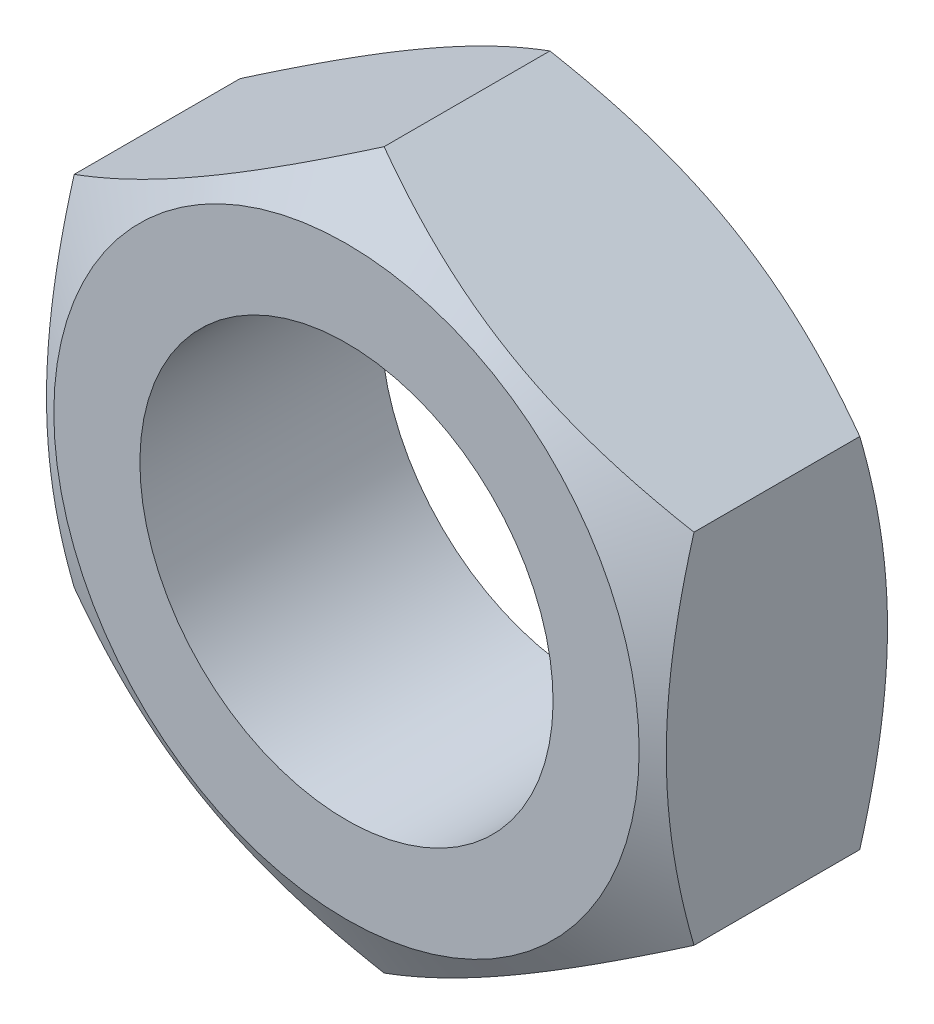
ISO-10303-21;
HEADER;
FILE_DESCRIPTION(('STEP AP214'),'2;1');
FILE_NAME('part.step','',(''),(''),'','','');
FILE_SCHEMA(('AUTOMOTIVE_DESIGN { 1 0 10303 214 1 1 1 1 }'));
ENDSEC;
DATA;
#1=APPLICATION_CONTEXT('core data for automotive mechanical design processes');
#2=APPLICATION_PROTOCOL_DEFINITION('international standard','automotive_design',2000,#1);
#3=PRODUCT_CONTEXT('',#1,'mechanical');
#4=PRODUCT('Part','Part','',(#3));
#5=PRODUCT_RELATED_PRODUCT_CATEGORY('part','',(#4));
#6=PRODUCT_DEFINITION_FORMATION('','',#4);
#7=PRODUCT_DEFINITION_CONTEXT('part definition',#1,'design');
#8=PRODUCT_DEFINITION('design','',#6,#7);
#9=PRODUCT_DEFINITION_SHAPE('','',#8);
#10=(LENGTH_UNIT() NAMED_UNIT(*) SI_UNIT(.MILLI.,.METRE.));
#11=(NAMED_UNIT(*) PLANE_ANGLE_UNIT() SI_UNIT($,.RADIAN.));
#12=(NAMED_UNIT(*) SI_UNIT($,.STERADIAN.) SOLID_ANGLE_UNIT());
#13=UNCERTAINTY_MEASURE_WITH_UNIT(LENGTH_MEASURE(1.E-05),#10,'distance_accuracy_value','');
#14=(GEOMETRIC_REPRESENTATION_CONTEXT(3) GLOBAL_UNCERTAINTY_ASSIGNED_CONTEXT((#13)) GLOBAL_UNIT_ASSIGNED_CONTEXT((#10,
#11,#12)) REPRESENTATION_CONTEXT('',''));
#15=CARTESIAN_POINT('',(0.,0.,0.));
#16=DIRECTION('',(0.,0.,1.));
#17=DIRECTION('',(1.,0.,0.));
#18=AXIS2_PLACEMENT_3D('',#15,#16,#17);
#19=CARTESIAN_POINT('',(18.,-10.3923048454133,21.));
#20=DIRECTION('',(0.5,-0.866025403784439,0.));
#21=DIRECTION('',(0.,0.,1.));
#22=AXIS2_PLACEMENT_3D('',#19,#20,#21);
#23=PLANE('',#22);
#24=CARTESIAN_POINT('',(33.1013058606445,-1.67356184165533,4.67949657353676));
#25=CARTESIAN_POINT('',(32.7611949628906,-1.86992496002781,4.86988083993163));
#26=CARTESIAN_POINT('',(32.4206829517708,-2.06651966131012,5.05930922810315));
#27=CARTESIAN_POINT('',(31.7387729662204,-2.46022057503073,5.43603758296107));
#28=CARTESIAN_POINT('',(31.3973749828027,-2.65732679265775,5.62333752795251));
#29=CARTESIAN_POINT('',(30.3716345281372,-3.24953832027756,6.18176961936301));
#30=CARTESIAN_POINT('',(29.6858473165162,-3.64547775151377,6.54937689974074));
#31=CARTESIAN_POINT('',(28.3058912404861,-4.44219576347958,7.27494989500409));
#32=CARTESIAN_POINT('',(27.6116970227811,-4.84298898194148,7.63285147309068));
#33=CARTESIAN_POINT('',(26.2177618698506,-5.64777781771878,8.33389910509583));
#34=CARTESIAN_POINT('',(25.5180212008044,-6.05177328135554,8.67704586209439));
#35=CARTESIAN_POINT('',(24.089603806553,-6.87647044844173,9.35525301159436));
#36=CARTESIAN_POINT('',(23.3607123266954,-7.29729614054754,9.68971348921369));
#37=CARTESIAN_POINT('',(21.8943694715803,-8.1438895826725,10.3331153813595));
#38=CARTESIAN_POINT('',(21.1569171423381,-8.56965788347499,10.6420539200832));
#39=CARTESIAN_POINT('',(19.6737078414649,-9.4259891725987,11.2262348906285));
#40=CARTESIAN_POINT('',(18.9279714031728,-9.85654030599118,11.5015462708));
#41=CARTESIAN_POINT('',(17.4257309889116,-10.7238592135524,12.0095975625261));
#42=CARTESIAN_POINT('',(16.6692305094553,-11.1606249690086,12.2423509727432));
#43=CARTESIAN_POINT('',(15.5283621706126,-11.8193056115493,12.5504656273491));
#44=CARTESIAN_POINT('',(15.1480817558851,-12.0388606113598,12.6461323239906));
#45=CARTESIAN_POINT('',(14.3849364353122,-12.4794627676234,12.8226446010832));
#46=CARTESIAN_POINT('',(14.002071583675,-12.7005098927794,12.9034904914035));
#47=CARTESIAN_POINT('',(13.234033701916,-13.1439367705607,13.048927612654));
#48=CARTESIAN_POINT('',(12.8488607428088,-13.3663164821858,13.1135193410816));
#49=CARTESIAN_POINT('',(12.0765995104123,-13.8121817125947,13.2251605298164));
#50=CARTESIAN_POINT('',(11.6895112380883,-14.0356672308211,13.2722099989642));
#51=CARTESIAN_POINT('',(10.9190041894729,-14.4805196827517,13.3472426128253));
#52=CARTESIAN_POINT('',(10.5356030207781,-14.7018764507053,13.3754653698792));
#53=CARTESIAN_POINT('',(9.76811172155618,-15.1449877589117,13.4131695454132));
#54=CARTESIAN_POINT('',(9.38402160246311,-15.3667422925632,13.4226512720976));
#55=CARTESIAN_POINT('',(8.6158361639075,-15.8102543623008,13.4226481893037));
#56=CARTESIAN_POINT('',(8.23174084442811,-16.0320118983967,13.41316322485));
#57=CARTESIAN_POINT('',(7.46423669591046,-16.4751306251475,13.3754565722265));
#58=CARTESIAN_POINT('',(7.08082789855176,-16.6964917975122,13.3472340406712));
#59=CARTESIAN_POINT('',(6.15715295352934,-17.2297757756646,13.2572670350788));
#60=CARTESIAN_POINT('',(5.61753522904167,-17.5413242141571,13.1864897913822));
#61=CARTESIAN_POINT('',(4.54235004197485,-18.1620826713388,13.0116941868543));
#62=CARTESIAN_POINT('',(4.00678314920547,-18.4712923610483,12.9076712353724));
#63=CARTESIAN_POINT('',(2.94019543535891,-19.0870870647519,12.6700847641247));
#64=CARTESIAN_POINT('',(2.40917853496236,-19.3936698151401,12.5364979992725));
#65=CARTESIAN_POINT('',(1.35249346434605,-20.0037472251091,12.243855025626));
#66=CARTESIAN_POINT('',(0.826825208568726,-20.3072419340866,12.0847992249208));
#67=CARTESIAN_POINT('',(-0.230723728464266,-20.9178180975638,11.7413233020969));
#68=CARTESIAN_POINT('',(-0.762486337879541,-21.2248313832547,11.556421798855));
#69=CARTESIAN_POINT('',(-1.82077201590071,-21.8358329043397,11.1677046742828));
#70=CARTESIAN_POINT('',(-2.34729505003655,-22.1398211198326,10.9638889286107));
#71=CARTESIAN_POINT('',(-3.39536516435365,-22.7449246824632,10.540562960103));
#72=CARTESIAN_POINT('',(-3.91691386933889,-23.0460409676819,10.3210580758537));
#73=CARTESIAN_POINT('',(-4.95570000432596,-23.6457844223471,9.86891767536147));
#74=CARTESIAN_POINT('',(-5.4729374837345,-23.9444116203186,9.63628230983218));
#75=CARTESIAN_POINT('',(-6.68947904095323,-24.6467822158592,9.0741737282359));
#76=CARTESIAN_POINT('',(-7.38716429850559,-25.0495909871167,8.74003626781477));
#77=CARTESIAN_POINT('',(-8.77665355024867,-25.8518129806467,8.05579037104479));
#78=CARTESIAN_POINT('',(-9.46845718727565,-26.2512259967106,7.70568097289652));
#79=CARTESIAN_POINT('',(-10.847275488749,-27.0472871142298,6.99268051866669));
#80=CARTESIAN_POINT('',(-11.5342890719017,-27.4439345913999,6.62978668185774));
#81=CARTESIAN_POINT('',(-12.9041740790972,-28.234838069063,5.89378778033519));
#82=CARTESIAN_POINT('',(-13.5870455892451,-28.6290941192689,5.52068292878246));
#83=CARTESIAN_POINT('',(-14.9500649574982,-29.4160337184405,4.76575939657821));
#84=CARTESIAN_POINT('',(-15.6302090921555,-29.8087151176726,4.38393176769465));
#85=CARTESIAN_POINT('',(-16.9875850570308,-30.5923964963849,3.61343696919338));
#86=CARTESIAN_POINT('',(-17.6648168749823,-30.983396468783,3.22476977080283));
#87=CARTESIAN_POINT('',(-19.0167312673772,-31.7639246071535,2.44181302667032));
#88=CARTESIAN_POINT('',(-19.6914141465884,-32.1534529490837,2.04752418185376));
#89=CARTESIAN_POINT('',(-21.038678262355,-32.9312962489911,1.25419602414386));
#90=CARTESIAN_POINT('',(-21.7112595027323,-33.3196112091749,0.855156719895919));
#91=CARTESIAN_POINT('',(-23.6143370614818,-34.4183535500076,-0.281092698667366));
#92=CARTESIAN_POINT('',(-24.8427217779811,-35.1275617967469,-1.02301830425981));
#93=CARTESIAN_POINT('',(-27.2949471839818,-36.543354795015,-2.51691004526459));
#94=CARTESIAN_POINT('',(-28.5187877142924,-37.249939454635,-3.26887652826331));
#95=CARTESIAN_POINT('',(-30.9599093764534,-38.6593217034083,-4.77865240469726));
#96=CARTESIAN_POINT('',(-32.1771992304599,-39.3621243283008,-5.53644300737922));
#97=CARTESIAN_POINT('',(-34.000989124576,-40.415089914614,-6.67760390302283));
#98=CARTESIAN_POINT('',(-34.6085455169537,-40.7658627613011,-7.0587265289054));
#99=CARTESIAN_POINT('',(-35.823024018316,-41.4670422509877,-7.82231443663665));
#100=CARTESIAN_POINT('',(-36.4299461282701,-41.8174488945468,-8.20477971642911));
#101=CARTESIAN_POINT('',(-37.036586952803,-42.1676931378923,-8.58783911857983));
#102=B_SPLINE_CURVE_WITH_KNOTS('',3,(#24,#25,#26,#27,#28,#29,#30,#31,#32,#33,#34,#35,#36,#37,
#38,#39,#40,#41,#42,#43,#44,#45,#46,#47,#48,#49,#50,#51,#52,#53,#54,#55,#56,#57,#58,#59,#60,#61,
#62,#63,#64,#65,#66,#67,#68,#69,#70,#71,#72,#73,#74,#75,#76,#77,#78,#79,#80,#81,#82,#83,#84,#85,
#86,#87,#88,#89,#90,#91,#92,#93,#94,#95,#96,#97,#98,#99,#100,#101),.UNSPECIFIED.,.F.,.F.,(4,2,2,
2,2,2,2,2,2,2,2,2,2,2,2,2,2,2,2,2,2,2,2,2,2,2,2,2,2,2,2,2,2,2,2,2,2,2,4),(0.,1.3093182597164,
2.61864985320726,5.23770498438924,7.87116263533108,10.5044946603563,13.2211931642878,
15.9381973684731,18.6495336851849,21.3600085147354,22.708030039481,24.0560233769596,
25.4039754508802,26.7519268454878,28.082377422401,29.4128061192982,30.7432456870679,
32.0737451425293,33.9540142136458,35.8345430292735,37.7165557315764,39.5985382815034,
41.5219602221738,43.4453948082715,45.368177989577,47.2909391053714,49.907193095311,
52.5236048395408,55.1405892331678,57.7575190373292,60.3772660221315,62.9970240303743,
65.6164582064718,68.2358876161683,73.0380377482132,77.8403545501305,82.630924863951,
85.0260829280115,87.4212373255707),.UNSPECIFIED.);
#103=CARTESIAN_POINT('',(0.,-20.7846096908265,11.8149545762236));
#104=VERTEX_POINT('',#103);
#105=CARTESIAN_POINT('',(18.,-10.3923048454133,11.8149545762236));
#106=VERTEX_POINT('',#105);
#107=EDGE_CURVE('E74',#104,#106,#102,.F.);
#108=ORIENTED_EDGE('',*,*,#107,.F.);
#109=DIRECTION('',(0.,0.,-1.));
#110=VECTOR('',#109,1.);
#111=CARTESIAN_POINT('',(0.,-20.7846096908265,21.));
#112=LINE('',#111,#110);
#113=CARTESIAN_POINT('',(0.,-20.7846096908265,2.18504542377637));
#114=VERTEX_POINT('',#113);
#115=EDGE_CURVE('E43',#104,#114,#112,.T.);
#116=ORIENTED_EDGE('',*,*,#115,.T.);
#117=CARTESIAN_POINT('',(33.1501142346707,-1.64538231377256,9.34783364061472));
#118=CARTESIAN_POINT('',(32.8098002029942,-1.84186271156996,9.15722210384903));
#119=CARTESIAN_POINT('',(32.469086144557,-2.0385740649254,8.96756328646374));
#120=CARTESIAN_POINT('',(31.7867744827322,-2.43250688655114,8.59036692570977));
#121=CARTESIAN_POINT('',(31.445176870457,-2.62972835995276,8.40282940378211));
#122=CARTESIAN_POINT('',(30.4188421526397,-3.22228298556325,7.84367291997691));
#123=CARTESIAN_POINT('',(29.7326642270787,-3.61844799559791,7.47556680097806));
#124=CARTESIAN_POINT('',(28.3519619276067,-4.41559683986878,6.74896572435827));
#125=CARTESIAN_POINT('',(27.6574124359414,-4.81659517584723,6.39053425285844));
#126=CARTESIAN_POINT('',(26.2627810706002,-5.6217859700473,5.68837276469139));
#127=CARTESIAN_POINT('',(25.5626994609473,-6.02597827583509,5.34464205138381));
#128=CARTESIAN_POINT('',(24.1334128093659,-6.85117730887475,4.66508646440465));
#129=CARTESIAN_POINT('',(23.4039916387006,-7.27230881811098,4.32986452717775));
#130=CARTESIAN_POINT('',(21.936601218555,-8.1195070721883,3.68486026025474));
#131=CARTESIAN_POINT('',(21.1986310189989,-8.54557436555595,3.37508078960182));
#132=CARTESIAN_POINT('',(19.7143818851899,-9.40250600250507,2.78911928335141));
#133=CARTESIAN_POINT('',(18.9681233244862,-9.83335858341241,2.51286899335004));
#134=CARTESIAN_POINT('',(17.4648308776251,-10.7012848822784,2.002833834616));
#135=CARTESIAN_POINT('',(16.7078004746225,-11.1383565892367,1.76903556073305));
#136=CARTESIAN_POINT('',(15.5661314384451,-11.7974995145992,1.45928805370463));
#137=CARTESIAN_POINT('',(15.1855920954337,-12.0172040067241,1.3630693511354));
#138=CARTESIAN_POINT('',(14.4219178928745,-12.4581115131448,1.18543230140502));
#139=CARTESIAN_POINT('',(14.0387830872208,-12.6793144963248,1.10401364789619));
#140=CARTESIAN_POINT('',(13.270191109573,-13.1230612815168,0.957417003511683));
#141=CARTESIAN_POINT('',(12.8847340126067,-13.3456050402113,0.892238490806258));
#142=CARTESIAN_POINT('',(12.1118862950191,-13.7918088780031,0.779419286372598));
#143=CARTESIAN_POINT('',(11.7244956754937,-14.0154689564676,0.731778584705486));
#144=CARTESIAN_POINT('',(10.9533918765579,-14.4606659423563,0.655581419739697));
#145=CARTESIAN_POINT('',(10.5696966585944,-14.6821924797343,0.626784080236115));
#146=CARTESIAN_POINT('',(9.80159629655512,-15.1256554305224,0.587949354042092));
#147=CARTESIAN_POINT('',(9.41719116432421,-15.3475918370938,0.577911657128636));
#148=CARTESIAN_POINT('',(8.64835590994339,-15.791479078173,0.576834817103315));
#149=CARTESIAN_POINT('',(8.26392578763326,-16.0134299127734,0.58579581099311));
#150=CARTESIAN_POINT('',(7.49573449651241,-16.4569453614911,0.62249843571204));
#151=CARTESIAN_POINT('',(7.11197335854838,-16.6785099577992,0.650240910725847));
#152=CARTESIAN_POINT('',(6.18894639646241,-17.2114198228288,0.738967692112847));
#153=CARTESIAN_POINT('',(5.65031508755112,-17.5223987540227,0.808909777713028));
#154=CARTESIAN_POINT('',(4.57706304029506,-18.1420411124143,0.981977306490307));
#155=CARTESIAN_POINT('',(4.04244286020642,-18.4507042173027,1.08510728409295));
#156=CARTESIAN_POINT('',(2.97771929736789,-19.06542265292,1.32088193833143));
#157=CARTESIAN_POINT('',(2.44761977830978,-19.3714757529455,1.45354965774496));
#158=CARTESIAN_POINT('',(1.39274450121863,-19.9805082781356,1.74435350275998));
#159=CARTESIAN_POINT('',(0.86796866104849,-20.283487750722,1.90248923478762));
#160=CARTESIAN_POINT('',(-0.187840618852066,-20.8930595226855,2.24413402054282));
#161=CARTESIAN_POINT('',(-0.718755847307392,-21.1995835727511,2.42812680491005));
#162=CARTESIAN_POINT('',(-1.77535556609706,-21.80961170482,2.81505170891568));
#163=CARTESIAN_POINT('',(-2.30104002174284,-22.1131157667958,3.01798395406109));
#164=CARTESIAN_POINT('',(-3.34743970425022,-22.7172549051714,3.43957168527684));
#165=CARTESIAN_POINT('',(-3.86815652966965,-23.0178909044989,3.65822190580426));
#166=CARTESIAN_POINT('',(-4.90527872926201,-23.6166736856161,4.10868007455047));
#167=CARTESIAN_POINT('',(-5.42168415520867,-23.9148204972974,4.34048786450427));
#168=CARTESIAN_POINT('',(-6.64582749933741,-24.6215799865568,4.90508424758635));
#169=CARTESIAN_POINT('',(-7.35184912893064,-25.0292017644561,5.24282717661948));
#170=CARTESIAN_POINT('',(-8.75785890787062,-25.8409618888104,5.93470997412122));
#171=CARTESIAN_POINT('',(-9.45784667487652,-26.2451000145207,6.28885087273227));
#172=CARTESIAN_POINT('',(-10.8529233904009,-27.0505479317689,7.01022148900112));
#173=CARTESIAN_POINT('',(-11.5480111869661,-27.4518570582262,7.37745416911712));
#174=CARTESIAN_POINT('',(-12.933954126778,-28.2520315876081,8.12234792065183));
#175=CARTESIAN_POINT('',(-13.6248093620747,-28.6508970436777,8.50000876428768));
#176=CARTESIAN_POINT('',(-15.0037583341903,-29.4470336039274,9.26421902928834));
#177=CARTESIAN_POINT('',(-15.6918481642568,-29.8443024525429,9.65077783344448));
#178=CARTESIAN_POINT('',(-17.0650638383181,-30.6371288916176,10.430851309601));
#179=CARTESIAN_POINT('',(-17.7501896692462,-31.0326864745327,10.8243660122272));
#180=CARTESIAN_POINT('',(-19.1178482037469,-31.8223044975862,11.6171011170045));
#181=CARTESIAN_POINT('',(-19.8003812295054,-32.2163651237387,12.016320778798));
#182=CARTESIAN_POINT('',(-21.1633153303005,-33.0032554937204,12.819574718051));
#183=CARTESIAN_POINT('',(-21.8437164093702,-33.3960852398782,13.2236089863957));
#184=CARTESIAN_POINT('',(-23.7672028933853,-34.506610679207,14.3730539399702));
#185=CARTESIAN_POINT('',(-25.0081578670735,-35.223076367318,15.1232179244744));
#186=CARTESIAN_POINT('',(-27.4854889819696,-36.6533641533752,16.6336600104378));
#187=CARTESIAN_POINT('',(-28.7218649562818,-37.3671861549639,17.3939384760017));
#188=CARTESIAN_POINT('',(-31.1879298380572,-38.790969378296,18.920315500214));
#189=CARTESIAN_POINT('',(-32.417627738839,-39.5009357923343,19.6863946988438));
#190=CARTESIAN_POINT('',(-34.2600181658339,-40.5646404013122,20.8400066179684));
#191=CARTESIAN_POINT('',(-34.8737722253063,-40.9189914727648,21.2252822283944));
#192=CARTESIAN_POINT('',(-36.1006433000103,-41.6273258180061,21.9971810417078));
#193=CARTESIAN_POINT('',(-36.71376031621,-41.9813090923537,22.3838042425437));
#194=CARTESIAN_POINT('',(-37.3265950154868,-42.33512937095,22.7710233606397));
#195=B_SPLINE_CURVE_WITH_KNOTS('',3,(#117,#118,#119,#120,#121,#122,#123,#124,#125,#126,#127,
#128,#129,#130,#131,#132,#133,#134,#135,#136,#137,#138,#139,#140,#141,#142,#143,#144,#145,#146,
#147,#148,#149,#150,#151,#152,#153,#154,#155,#156,#157,#158,#159,#160,#161,#162,#163,#164,#165,
#166,#167,#168,#169,#170,#171,#172,#173,#174,#175,#176,#177,#178,#179,#180,#181,#182,#183,#184,
#185,#186,#187,#188,#189,#190,#191,#192,#193,#194),.UNSPECIFIED.,.F.,.F.,(4,2,2,2,2,2,2,2,2,2,2,
2,2,2,2,2,2,2,2,2,2,2,2,2,2,2,2,2,2,2,2,2,2,2,2,2,2,2,4),(0.,1.31024892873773,2.62051108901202,
5.2414246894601,7.87665527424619,10.5117608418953,13.2310107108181,15.9505657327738,
18.6644883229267,21.3775524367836,22.7268043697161,24.0760283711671,25.425209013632,
26.7743888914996,28.1059664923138,29.4375220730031,30.7690872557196,32.1007122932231,
33.9773078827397,35.8541599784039,37.7324813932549,39.6107737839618,41.5305984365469,
43.4504358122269,45.3696330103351,47.2888071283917,49.9358687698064,52.5830969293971,
55.2309279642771,57.8787012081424,60.5294074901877,63.180125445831,65.8305024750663,
68.480874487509,73.3330647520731,78.1854301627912,83.0256354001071,85.4456062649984,
87.8655734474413),.UNSPECIFIED.);
#196=CARTESIAN_POINT('',(18.,-10.3923048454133,2.18504542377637));
#197=VERTEX_POINT('',#196);
#198=EDGE_CURVE('E92',#197,#114,#195,.T.);
#199=ORIENTED_EDGE('',*,*,#198,.F.);
#200=DIRECTION('',(0.,0.,-1.));
#201=VECTOR('',#200,1.);
#202=CARTESIAN_POINT('',(18.,-10.3923048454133,21.));
#203=LINE('',#202,#201);
#204=EDGE_CURVE('E29',#106,#197,#203,.T.);
#205=ORIENTED_EDGE('',*,*,#204,.F.);
#206=EDGE_LOOP('',(#108,#116,#199,#205));
#207=FACE_BOUND('',#206,.T.);
#208=ADVANCED_FACE('F14',(#207),#23,.T.);
#209=CARTESIAN_POINT('',(18.,-10.3923048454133,21.));
#210=DIRECTION('',(-1.,0.,0.));
#211=DIRECTION('',(0.,-1.,0.));
#212=AXIS2_PLACEMENT_3D('',#209,#210,#211);
#213=PLANE('',#212);
#214=DIRECTION('',(0.,0.,-1.));
#215=VECTOR('',#214,1.);
#216=CARTESIAN_POINT('',(18.,10.3923048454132,21.));
#217=LINE('',#216,#215);
#218=CARTESIAN_POINT('',(18.,10.3923048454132,11.8149545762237));
#219=VERTEX_POINT('',#218);
#220=CARTESIAN_POINT('',(18.,10.3923048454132,2.18504542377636));
#221=VERTEX_POINT('',#220);
#222=EDGE_CURVE('E99',#219,#221,#217,.T.);
#223=ORIENTED_EDGE('',*,*,#222,.F.);
#224=CARTESIAN_POINT('',(18.,10.3925357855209,11.8148879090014));
#225=CARTESIAN_POINT('',(18.,9.93569862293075,11.9467563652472));
#226=CARTESIAN_POINT('',(18.,9.47707955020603,12.0726408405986));
#227=CARTESIAN_POINT('',(18.,8.55616382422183,12.3107784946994));
#228=CARTESIAN_POINT('',(18.,8.09386601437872,12.423027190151));
#229=CARTESIAN_POINT('',(18.,7.16469933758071,12.6323844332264));
#230=CARTESIAN_POINT('',(18.,6.6978223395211,12.7294571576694));
#231=CARTESIAN_POINT('',(18.,5.76082423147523,12.9063779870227));
#232=CARTESIAN_POINT('',(18.,5.29070330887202,12.9862270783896));
#233=CARTESIAN_POINT('',(18.,4.35926343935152,13.1253044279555));
#234=CARTESIAN_POINT('',(18.,3.89801364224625,13.1849930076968));
#235=CARTESIAN_POINT('',(18.,2.97340053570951,13.2850773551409));
#236=CARTESIAN_POINT('',(18.,2.51003718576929,13.3254727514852));
#237=CARTESIAN_POINT('',(18.,1.58253212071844,13.3859507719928));
#238=CARTESIAN_POINT('',(18.,1.11839199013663,13.4060575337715));
#239=CARTESIAN_POINT('',(18.,0.189683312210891,13.425525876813));
#240=CARTESIAN_POINT('',(18.,-0.274885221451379,13.4248880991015));
#241=CARTESIAN_POINT('',(18.,-1.14340680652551,13.404316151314));
#242=CARTESIAN_POINT('',(18.,-1.54742174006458,13.3868905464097));
#243=CARTESIAN_POINT('',(18.,-2.35448787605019,13.3366806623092));
#244=CARTESIAN_POINT('',(18.,-2.75753909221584,13.3038966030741));
#245=CARTESIAN_POINT('',(18.,-3.56252508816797,13.2235386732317));
#246=CARTESIAN_POINT('',(18.,-3.96445852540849,13.1759514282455));
#247=CARTESIAN_POINT('',(18.,-4.76641202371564,13.0668268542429));
#248=CARTESIAN_POINT('',(18.,-5.16643209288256,13.0052895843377));
#249=CARTESIAN_POINT('',(18.,-6.38074459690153,12.7981876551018));
#250=CARTESIAN_POINT('',(18.,-7.19152050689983,12.6319722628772));
#251=CARTESIAN_POINT('',(18.,-8.80098283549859,12.2547315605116));
#252=CARTESIAN_POINT('',(18.,-9.59968985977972,12.0437948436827));
#253=CARTESIAN_POINT('',(18.,-10.3925357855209,11.8148879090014));
#254=B_SPLINE_CURVE_WITH_KNOTS('',3,(#224,#225,#226,#227,#228,#229,#230,#231,#232,#233,#234,
#235,#236,#237,#238,#239,#240,#241,#242,#243,#244,#245,#246,#247,#248,#249,#250,#251,#252,#253),
.UNSPECIFIED.,.F.,.F.,(4,2,2,2,2,2,2,2,2,2,2,2,2,2,4),(0.,1.42650335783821,2.85347447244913,
4.28376471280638,5.71397301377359,7.10888071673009,8.50381526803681,9.89708828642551,
11.2903182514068,12.5031974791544,13.7160593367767,14.9300201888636,16.1439758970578,
18.6253607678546,21.1018751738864),.UNSPECIFIED.);
#255=EDGE_CURVE('E80',#219,#106,#254,.T.);
#256=ORIENTED_EDGE('',*,*,#255,.T.);
#257=ORIENTED_EDGE('',*,*,#204,.T.);
#258=CARTESIAN_POINT('',(18.,-10.3925357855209,2.18511209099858));
#259=CARTESIAN_POINT('',(18.,-9.93569862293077,2.05324363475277));
#260=CARTESIAN_POINT('',(18.,-9.47707955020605,1.92735915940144));
#261=CARTESIAN_POINT('',(18.,-8.55616382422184,1.68922150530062));
#262=CARTESIAN_POINT('',(18.,-8.09386601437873,1.57697280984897));
#263=CARTESIAN_POINT('',(18.,-7.16469933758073,1.3676155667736));
#264=CARTESIAN_POINT('',(18.,-6.69782233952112,1.27054284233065));
#265=CARTESIAN_POINT('',(18.,-5.76082423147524,1.0936220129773));
#266=CARTESIAN_POINT('',(18.,-5.29070330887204,1.01377292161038));
#267=CARTESIAN_POINT('',(18.,-4.35926343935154,0.874695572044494));
#268=CARTESIAN_POINT('',(18.,-3.89801364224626,0.815006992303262));
#269=CARTESIAN_POINT('',(18.,-2.97340053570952,0.714922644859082));
#270=CARTESIAN_POINT('',(18.,-2.51003718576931,0.674527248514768));
#271=CARTESIAN_POINT('',(18.,-1.58253212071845,0.614049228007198));
#272=CARTESIAN_POINT('',(18.,-1.11839199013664,0.593942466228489));
#273=CARTESIAN_POINT('',(18.,-0.189683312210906,0.57447412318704));
#274=CARTESIAN_POINT('',(18.,0.274885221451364,0.575111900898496));
#275=CARTESIAN_POINT('',(18.,1.14340680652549,0.595683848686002));
#276=CARTESIAN_POINT('',(18.,1.54742174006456,0.613109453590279));
#277=CARTESIAN_POINT('',(18.,2.35448787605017,0.663319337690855));
#278=CARTESIAN_POINT('',(18.,2.75753909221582,0.696103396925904));
#279=CARTESIAN_POINT('',(18.,3.56252508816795,0.776461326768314));
#280=CARTESIAN_POINT('',(18.,3.96445852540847,0.82404857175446));
#281=CARTESIAN_POINT('',(18.,4.76641202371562,0.933173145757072));
#282=CARTESIAN_POINT('',(18.,5.16643209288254,0.994710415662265));
#283=CARTESIAN_POINT('',(18.,6.38074459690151,1.20181234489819));
#284=CARTESIAN_POINT('',(18.,7.19152050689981,1.36802773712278));
#285=CARTESIAN_POINT('',(18.,8.80098283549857,1.74526843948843));
#286=CARTESIAN_POINT('',(18.,9.5996898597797,1.95620515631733));
#287=CARTESIAN_POINT('',(18.,10.3925357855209,2.18511209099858));
#288=B_SPLINE_CURVE_WITH_KNOTS('',3,(#258,#259,#260,#261,#262,#263,#264,#265,#266,#267,#268,
#269,#270,#271,#272,#273,#274,#275,#276,#277,#278,#279,#280,#281,#282,#283,#284,#285,#286,#287),
.UNSPECIFIED.,.F.,.F.,(4,2,2,2,2,2,2,2,2,2,2,2,2,2,4),(0.,1.42650335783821,2.85347447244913,
4.28376471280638,5.71397301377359,7.10888071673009,8.50381526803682,9.89708828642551,
11.2903182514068,12.5031974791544,13.7160593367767,14.9300201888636,16.1439758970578,
18.6253607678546,21.1018751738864),.UNSPECIFIED.);
#289=EDGE_CURVE('E164',#197,#221,#288,.T.);
#290=ORIENTED_EDGE('',*,*,#289,.T.);
#291=EDGE_LOOP('',(#223,#256,#257,#290));
#292=FACE_BOUND('',#291,.T.);
#293=ADVANCED_FACE('F16',(#292),#213,.F.);
#294=CARTESIAN_POINT('',(0.,20.7846096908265,21.));
#295=DIRECTION('',(0.5,0.866025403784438,0.));
#296=DIRECTION('',(-0.866025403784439,0.5,0.));
#297=AXIS2_PLACEMENT_3D('',#294,#295,#296);
#298=PLANE('',#297);
#299=CARTESIAN_POINT('',(18.0002,10.3921893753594,11.8148879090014));
#300=CARTESIAN_POINT('',(17.6045674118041,10.6206079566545,11.9467563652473));
#301=CARTESIAN_POINT('',(17.2073916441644,10.8499174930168,12.0726408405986));
#302=CARTESIAN_POINT('',(16.4098552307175,11.3103753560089,12.3107784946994));
#303=CARTESIAN_POINT('',(16.0094935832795,11.5415242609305,12.4230271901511));
#304=CARTESIAN_POINT('',(15.2048116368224,12.0061075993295,12.6323844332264));
#305=CARTESIAN_POINT('',(14.8004842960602,12.2395460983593,12.7294571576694));
#306=CARTESIAN_POINT('',(13.9890201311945,12.7080451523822,12.9063779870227));
#307=CARTESIAN_POINT('',(13.5818834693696,12.9431056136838,12.9862270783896));
#308=CARTESIAN_POINT('',(12.7752328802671,13.4088255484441,13.1253044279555));
#309=CARTESIAN_POINT('',(12.3757788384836,13.6394504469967,13.1849930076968));
#310=CARTESIAN_POINT('',(11.5750403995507,14.1017570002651,13.2850773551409));
#311=CARTESIAN_POINT('',(11.1737559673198,14.3334386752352,13.3254727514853));
#312=CARTESIAN_POINT('',(10.370513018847,14.7971912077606,13.3859507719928));
#313=CARTESIAN_POINT('',(9.96855587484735,15.0292612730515,13.4060575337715));
#314=CARTESIAN_POINT('',(9.16427056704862,15.4936156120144,13.425525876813));
#315=CARTESIAN_POINT('',(8.76194241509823,15.7258998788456,13.4248880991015));
#316=CARTESIAN_POINT('',(8.0097806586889,16.1601606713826,13.404316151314));
#317=CARTESIAN_POINT('',(7.65989346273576,16.3621681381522,13.3868905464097));
#318=CARTESIAN_POINT('',(6.96095368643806,16.7657012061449,13.3366806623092));
#319=CARTESIAN_POINT('',(6.6119010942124,16.9672268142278,13.3038966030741));
#320=CARTESIAN_POINT('',(5.91476277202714,17.3697198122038,13.2235386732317));
#321=CARTESIAN_POINT('',(5.56667820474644,17.5706865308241,13.1759514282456));
#322=CARTESIAN_POINT('',(4.87216610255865,17.9716632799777,13.066826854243));
#323=CARTESIAN_POINT('',(4.52573856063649,18.1716733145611,13.0052895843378));
#324=CARTESIAN_POINT('',(3.47411308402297,18.7788295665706,12.7981876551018));
#325=CARTESIAN_POINT('',(2.77196054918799,19.1842175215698,12.6319722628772));
#326=CARTESIAN_POINT('',(1.3781252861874,19.9889486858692,12.2547315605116));
#327=CARTESIAN_POINT('',(0.686424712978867,20.3883021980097,12.0437948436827));
#328=CARTESIAN_POINT('',(-0.000200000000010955,20.7847251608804,11.8148879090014));
#329=B_SPLINE_CURVE_WITH_KNOTS('',3,(#299,#300,#301,#302,#303,#304,#305,#306,#307,#308,#309,
#310,#311,#312,#313,#314,#315,#316,#317,#318,#319,#320,#321,#322,#323,#324,#325,#326,#327,#328),
.UNSPECIFIED.,.F.,.F.,(4,2,2,2,2,2,2,2,2,2,2,2,2,2,4),(0.,1.42650335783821,2.85347447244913,
4.28376471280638,5.71397301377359,7.10888071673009,8.50381526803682,9.89708828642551,
11.2903182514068,12.5031974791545,13.7160593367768,14.9300201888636,16.1439758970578,
18.6253607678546,21.1018751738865),.UNSPECIFIED.);
#330=CARTESIAN_POINT('',(0.,20.7846096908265,11.8149545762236));
#331=VERTEX_POINT('',#330);
#332=EDGE_CURVE('E135',#219,#331,#329,.T.);
#333=ORIENTED_EDGE('',*,*,#332,.F.);
#334=ORIENTED_EDGE('',*,*,#222,.T.);
#335=CARTESIAN_POINT('',(-0.000200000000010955,20.7847251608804,2.18511209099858));
#336=CARTESIAN_POINT('',(0.395432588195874,20.5563065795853,2.05324363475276));
#337=CARTESIAN_POINT('',(0.792608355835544,20.3269970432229,1.92735915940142));
#338=CARTESIAN_POINT('',(1.59014476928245,19.8665391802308,1.68922150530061));
#339=CARTESIAN_POINT('',(1.9905064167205,19.6353902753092,1.57697280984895));
#340=CARTESIAN_POINT('',(2.79518836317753,19.1708069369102,1.36761556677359));
#341=CARTESIAN_POINT('',(3.19951570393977,18.9373684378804,1.27054284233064));
#342=CARTESIAN_POINT('',(4.01097986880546,18.4688693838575,1.09362201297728));
#343=CARTESIAN_POINT('',(4.41811653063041,18.2338089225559,1.01377292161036));
#344=CARTESIAN_POINT('',(5.22476711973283,17.7680889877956,0.874695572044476));
#345=CARTESIAN_POINT('',(5.62422116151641,17.537464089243,0.815006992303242));
#346=CARTESIAN_POINT('',(6.42495960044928,17.0751575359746,0.714922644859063));
#347=CARTESIAN_POINT('',(6.82624403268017,16.8434758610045,0.674527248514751));
#348=CARTESIAN_POINT('',(7.62948698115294,16.3797233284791,0.61404922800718));
#349=CARTESIAN_POINT('',(8.03144412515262,16.1476532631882,0.593942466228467));
#350=CARTESIAN_POINT('',(8.83572943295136,15.6832989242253,0.574474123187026));
#351=CARTESIAN_POINT('',(9.23805758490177,15.4510146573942,0.575111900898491));
#352=CARTESIAN_POINT('',(9.99021934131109,15.0167538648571,0.595683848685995));
#353=CARTESIAN_POINT('',(10.3401065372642,14.8147463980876,0.613109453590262));
#354=CARTESIAN_POINT('',(11.0390463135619,14.4112133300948,0.663319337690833));
#355=CARTESIAN_POINT('',(11.3880989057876,14.209687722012,0.696103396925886));
#356=CARTESIAN_POINT('',(12.0852372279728,13.8071947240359,0.7764613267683));
#357=CARTESIAN_POINT('',(12.4333217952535,13.6062280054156,0.824048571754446));
#358=CARTESIAN_POINT('',(13.1278338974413,13.205251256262,0.933173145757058));
#359=CARTESIAN_POINT('',(13.4742614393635,13.0052412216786,0.99471041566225));
#360=CARTESIAN_POINT('',(14.525886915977,12.3980849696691,1.20181234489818));
#361=CARTESIAN_POINT('',(15.228039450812,11.9926970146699,1.36802773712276));
#362=CARTESIAN_POINT('',(16.6218747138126,11.1879658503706,1.74526843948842));
#363=CARTESIAN_POINT('',(17.3135752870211,10.78861233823,1.95620515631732));
#364=CARTESIAN_POINT('',(18.0002,10.3921893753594,2.18511209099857));
#365=B_SPLINE_CURVE_WITH_KNOTS('',3,(#335,#336,#337,#338,#339,#340,#341,#342,#343,#344,#345,
#346,#347,#348,#349,#350,#351,#352,#353,#354,#355,#356,#357,#358,#359,#360,#361,#362,#363,#364),
.UNSPECIFIED.,.F.,.F.,(4,2,2,2,2,2,2,2,2,2,2,2,2,2,4),(0.,1.42650335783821,2.85347447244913,
4.28376471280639,5.7139730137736,7.10888071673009,8.50381526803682,9.89708828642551,
11.2903182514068,12.5031974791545,13.7160593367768,14.9300201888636,16.1439758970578,
18.6253607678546,21.1018751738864),.UNSPECIFIED.);
#366=CARTESIAN_POINT('',(0.,20.7846096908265,2.18504542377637));
#367=VERTEX_POINT('',#366);
#368=EDGE_CURVE('E196',#367,#221,#365,.T.);
#369=ORIENTED_EDGE('',*,*,#368,.F.);
#370=DIRECTION('',(0.,0.,-1.));
#371=VECTOR('',#370,1.);
#372=CARTESIAN_POINT('',(0.,20.7846096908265,21.));
#373=LINE('',#372,#371);
#374=EDGE_CURVE('E97',#331,#367,#373,.T.);
#375=ORIENTED_EDGE('',*,*,#374,.F.);
#376=EDGE_LOOP('',(#333,#334,#369,#375));
#377=FACE_BOUND('',#376,.T.);
#378=ADVANCED_FACE('F202',(#377),#298,.T.);
#379=CARTESIAN_POINT('',(0.,20.7846096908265,21.));
#380=DIRECTION('',(0.5,-0.866025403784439,0.));
#381=DIRECTION('',(0.,0.,1.));
#382=AXIS2_PLACEMENT_3D('',#379,#380,#381);
#383=PLANE('',#382);
#384=DIRECTION('',(0.,0.,-1.));
#385=VECTOR('',#384,1.);
#386=CARTESIAN_POINT('',(-18.,10.3923048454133,21.));
#387=LINE('',#386,#385);
#388=CARTESIAN_POINT('',(-18.,10.3923048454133,11.8149545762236));
#389=VERTEX_POINT('',#388);
#390=CARTESIAN_POINT('',(-18.,10.3923048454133,2.18504542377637));
#391=VERTEX_POINT('',#390);
#392=EDGE_CURVE('E89',#389,#391,#387,.T.);
#393=ORIENTED_EDGE('',*,*,#392,.F.);
#394=CARTESIAN_POINT('',(15.1013058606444,29.5033526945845,4.67949657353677));
#395=CARTESIAN_POINT('',(14.7611949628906,29.306989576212,4.86988083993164));
#396=CARTESIAN_POINT('',(14.4206829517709,29.1103948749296,5.05930922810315));
#397=CARTESIAN_POINT('',(13.7387729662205,28.716693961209,5.43603758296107));
#398=CARTESIAN_POINT('',(13.3973749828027,28.519587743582,5.62333752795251));
#399=CARTESIAN_POINT('',(12.3716345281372,27.9273762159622,6.18176961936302));
#400=CARTESIAN_POINT('',(11.6858473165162,27.531436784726,6.54937689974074));
#401=CARTESIAN_POINT('',(10.3058912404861,26.7347187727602,7.2749498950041));
#402=CARTESIAN_POINT('',(9.61169702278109,26.3339255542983,7.63285147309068));
#403=CARTESIAN_POINT('',(8.21776186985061,25.529136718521,8.33389910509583));
#404=CARTESIAN_POINT('',(7.51802120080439,25.1251412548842,8.6770458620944));
#405=CARTESIAN_POINT('',(6.08960380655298,24.300444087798,9.35525301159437));
#406=CARTESIAN_POINT('',(5.3607123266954,23.8796183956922,9.6897134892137));
#407=CARTESIAN_POINT('',(3.89436947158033,23.0330249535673,10.3331153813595));
#408=CARTESIAN_POINT('',(3.15691714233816,22.6072566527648,10.6420539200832));
#409=CARTESIAN_POINT('',(1.67370784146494,21.7509253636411,11.2262348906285));
#410=CARTESIAN_POINT('',(0.927971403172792,21.3203742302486,11.5015462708));
#411=CARTESIAN_POINT('',(-0.574269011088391,20.4530553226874,12.0095975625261));
#412=CARTESIAN_POINT('',(-1.33076949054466,20.0162895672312,12.2423509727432));
#413=CARTESIAN_POINT('',(-2.4716378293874,19.3576089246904,12.5504656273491));
#414=CARTESIAN_POINT('',(-2.85191824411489,19.13805392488,12.6461323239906));
#415=CARTESIAN_POINT('',(-3.61506356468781,18.6974517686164,12.8226446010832));
#416=CARTESIAN_POINT('',(-3.997928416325,18.4764046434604,12.9034904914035));
#417=CARTESIAN_POINT('',(-4.765966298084,18.032977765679,13.048927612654));
#418=CARTESIAN_POINT('',(-5.15113925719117,17.8105980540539,13.1135193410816));
#419=CARTESIAN_POINT('',(-5.92340048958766,17.3647328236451,13.2251605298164));
#420=CARTESIAN_POINT('',(-6.31048876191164,17.1412473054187,13.2722099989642));
#421=CARTESIAN_POINT('',(-7.08099581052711,16.6963948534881,13.3472426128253));
#422=CARTESIAN_POINT('',(-7.46439697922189,16.4750380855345,13.3754653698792));
#423=CARTESIAN_POINT('',(-8.23188827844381,16.031926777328,13.4131695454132));
#424=CARTESIAN_POINT('',(-8.61597839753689,15.8101722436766,13.4226512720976));
#425=CARTESIAN_POINT('',(-9.3841638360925,15.3666601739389,13.4226481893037));
#426=CARTESIAN_POINT('',(-9.76825915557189,15.144902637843,13.41316322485));
#427=CARTESIAN_POINT('',(-10.5357633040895,14.7017839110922,13.3754565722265));
#428=CARTESIAN_POINT('',(-10.9191721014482,14.4804227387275,13.3472340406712));
#429=CARTESIAN_POINT('',(-11.8428470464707,13.9471387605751,13.2572670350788));
#430=CARTESIAN_POINT('',(-12.3824647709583,13.6355903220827,13.1864897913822));
#431=CARTESIAN_POINT('',(-13.4576499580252,13.0148318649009,13.0116941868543));
#432=CARTESIAN_POINT('',(-13.9932168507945,12.7056221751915,12.9076712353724));
#433=CARTESIAN_POINT('',(-15.0598045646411,12.0898274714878,12.6700847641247));
#434=CARTESIAN_POINT('',(-15.5908214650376,11.7832447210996,12.5364979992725));
#435=CARTESIAN_POINT('',(-16.647506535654,11.1731673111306,12.243855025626));
#436=CARTESIAN_POINT('',(-17.1731747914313,10.8696726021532,12.0847992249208));
#437=CARTESIAN_POINT('',(-18.2307237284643,10.259096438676,11.7413233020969));
#438=CARTESIAN_POINT('',(-18.7624863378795,9.95208315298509,11.556421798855));
#439=CARTESIAN_POINT('',(-19.8207720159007,9.34108163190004,11.1677046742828));
#440=CARTESIAN_POINT('',(-20.3472950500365,9.03709341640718,10.9638889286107));
#441=CARTESIAN_POINT('',(-21.3953651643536,8.4319898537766,10.540562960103));
#442=CARTESIAN_POINT('',(-21.9169138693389,8.13087356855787,10.3210580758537));
#443=CARTESIAN_POINT('',(-22.9557000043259,7.53113011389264,9.86891767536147));
#444=CARTESIAN_POINT('',(-23.4729374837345,7.23250291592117,9.63628230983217));
#445=CARTESIAN_POINT('',(-24.6894790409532,6.53013232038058,9.07417372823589));
#446=CARTESIAN_POINT('',(-25.3871642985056,6.12732354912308,8.74003626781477));
#447=CARTESIAN_POINT('',(-26.7766535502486,5.3251015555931,8.05579037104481));
#448=CARTESIAN_POINT('',(-27.4684571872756,4.92568853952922,7.70568097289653));
#449=CARTESIAN_POINT('',(-28.8472754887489,4.12962742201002,6.99268051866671));
#450=CARTESIAN_POINT('',(-29.5342890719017,3.73297994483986,6.62978668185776));
#451=CARTESIAN_POINT('',(-30.9041740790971,2.94207646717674,5.89378778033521));
#452=CARTESIAN_POINT('',(-31.587045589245,2.54782041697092,5.52068292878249));
#453=CARTESIAN_POINT('',(-32.9500649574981,1.76088081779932,4.76575939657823));
#454=CARTESIAN_POINT('',(-33.6302090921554,1.36819941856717,4.38393176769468));
#455=CARTESIAN_POINT('',(-34.9875850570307,0.584518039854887,3.61343696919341));
#456=CARTESIAN_POINT('',(-35.6648168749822,0.193518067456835,3.22476977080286));
#457=CARTESIAN_POINT('',(-37.0167312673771,-0.587010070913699,2.44181302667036));
#458=CARTESIAN_POINT('',(-37.6914141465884,-0.976538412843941,2.0475241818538));
#459=CARTESIAN_POINT('',(-39.0386782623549,-1.7543817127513,1.2541960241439));
#460=CARTESIAN_POINT('',(-39.7112595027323,-2.14269667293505,0.855156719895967));
#461=CARTESIAN_POINT('',(-41.6143370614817,-3.24143901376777,-0.281092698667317));
#462=CARTESIAN_POINT('',(-42.842721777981,-3.95064726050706,-1.02301830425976));
#463=CARTESIAN_POINT('',(-45.2949471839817,-5.36644025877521,-2.51691004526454));
#464=CARTESIAN_POINT('',(-46.5187877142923,-6.07302491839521,-3.26887652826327));
#465=CARTESIAN_POINT('',(-48.9599093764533,-7.4824071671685,-4.77865240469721));
#466=CARTESIAN_POINT('',(-50.1771992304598,-8.18520979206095,-5.53644300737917));
#467=CARTESIAN_POINT('',(-52.0009891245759,-9.23817537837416,-6.67760390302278));
#468=CARTESIAN_POINT('',(-52.6085455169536,-9.58894822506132,-7.05872652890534));
#469=CARTESIAN_POINT('',(-53.8230240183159,-10.2901277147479,-7.8223144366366));
#470=CARTESIAN_POINT('',(-54.42994612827,-10.640534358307,-8.20477971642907));
#471=CARTESIAN_POINT('',(-55.0365869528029,-10.9907786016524,-8.58783911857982));
#472=B_SPLINE_CURVE_WITH_KNOTS('',3,(#394,#395,#396,#397,#398,#399,#400,#401,#402,#403,#404,
#405,#406,#407,#408,#409,#410,#411,#412,#413,#414,#415,#416,#417,#418,#419,#420,#421,#422,#423,
#424,#425,#426,#427,#428,#429,#430,#431,#432,#433,#434,#435,#436,#437,#438,#439,#440,#441,#442,
#443,#444,#445,#446,#447,#448,#449,#450,#451,#452,#453,#454,#455,#456,#457,#458,#459,#460,#461,
#462,#463,#464,#465,#466,#467,#468,#469,#470,#471),.UNSPECIFIED.,.F.,.F.,(4,2,2,2,2,2,2,2,2,2,2,
2,2,2,2,2,2,2,2,2,2,2,2,2,2,2,2,2,2,2,2,2,2,2,2,2,2,2,4),(0.,1.30931825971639,2.61864985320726,
5.23770498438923,7.87116263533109,10.5044946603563,13.2211931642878,15.9381973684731,
18.6495336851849,21.3600085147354,22.708030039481,24.0560233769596,25.4039754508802,
26.7519268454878,28.082377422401,29.4128061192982,30.7432456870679,32.0737451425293,
33.9540142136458,35.8345430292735,37.7165557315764,39.5985382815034,41.5219602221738,
43.4453948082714,45.368177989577,47.2909391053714,49.907193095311,52.5236048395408,
55.1405892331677,57.7575190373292,60.3772660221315,62.9970240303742,65.6164582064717,
68.2358876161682,73.0380377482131,77.8403545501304,82.630924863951,85.0260829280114,
87.4212373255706),.UNSPECIFIED.);
#473=EDGE_CURVE('E106',#389,#331,#472,.F.);
#474=ORIENTED_EDGE('',*,*,#473,.T.);
#475=ORIENTED_EDGE('',*,*,#374,.T.);
#476=CARTESIAN_POINT('',(15.1501142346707,29.5315322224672,9.34783364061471));
#477=CARTESIAN_POINT('',(14.8098002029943,29.3350518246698,9.15722210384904));
#478=CARTESIAN_POINT('',(14.469086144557,29.1383404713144,8.96756328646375));
#479=CARTESIAN_POINT('',(13.7867744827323,28.7444076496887,8.59036692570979));
#480=CARTESIAN_POINT('',(13.4451768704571,28.547186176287,8.40282940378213));
#481=CARTESIAN_POINT('',(12.4188421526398,27.9546315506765,7.84367291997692));
#482=CARTESIAN_POINT('',(11.7326642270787,27.5584665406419,7.47556680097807));
#483=CARTESIAN_POINT('',(10.3519619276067,26.761317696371,6.74896572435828));
#484=CARTESIAN_POINT('',(9.65741243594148,26.3603193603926,6.39053425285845));
#485=CARTESIAN_POINT('',(8.26278107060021,25.5551285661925,5.68837276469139));
#486=CARTESIAN_POINT('',(7.56269946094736,25.1509362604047,5.34464205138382));
#487=CARTESIAN_POINT('',(6.13341280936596,24.325737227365,4.66508646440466));
#488=CARTESIAN_POINT('',(5.40399163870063,23.9046057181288,4.32986452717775));
#489=CARTESIAN_POINT('',(3.93660121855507,23.0574074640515,3.68486026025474));
#490=CARTESIAN_POINT('',(3.19863101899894,22.6313401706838,3.37508078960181));
#491=CARTESIAN_POINT('',(1.7143818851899,21.7744085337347,2.7891192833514));
#492=CARTESIAN_POINT('',(0.968123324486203,21.3435559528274,2.51286899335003));
#493=CARTESIAN_POINT('',(-0.535169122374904,20.4756296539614,2.002833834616));
#494=CARTESIAN_POINT('',(-1.29219952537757,20.0385579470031,1.76903556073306));
#495=CARTESIAN_POINT('',(-2.43386856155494,19.3794150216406,1.45928805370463));
#496=CARTESIAN_POINT('',(-2.81440790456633,19.1597105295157,1.36306935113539));
#497=CARTESIAN_POINT('',(-3.5780821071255,18.718803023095,1.18543230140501));
#498=CARTESIAN_POINT('',(-3.96121691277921,18.4976000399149,1.10401364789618));
#499=CARTESIAN_POINT('',(-4.729808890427,18.053853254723,0.957417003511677));
#500=CARTESIAN_POINT('',(-5.11526598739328,17.8313094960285,0.892238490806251));
#501=CARTESIAN_POINT('',(-5.88811370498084,17.3851056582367,0.779419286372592));
#502=CARTESIAN_POINT('',(-6.27550432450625,17.1614455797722,0.73177858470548));
#503=CARTESIAN_POINT('',(-7.04660812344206,16.7162485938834,0.655581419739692));
#504=CARTESIAN_POINT('',(-7.43030334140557,16.4947220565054,0.626784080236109));
#505=CARTESIAN_POINT('',(-8.19840370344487,16.0512591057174,0.587949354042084));
#506=CARTESIAN_POINT('',(-8.58280883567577,15.829322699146,0.577911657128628));
#507=CARTESIAN_POINT('',(-9.35164409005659,15.3854354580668,0.576834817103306));
#508=CARTESIAN_POINT('',(-9.73607421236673,15.1634846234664,0.585795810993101));
#509=CARTESIAN_POINT('',(-10.5042655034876,14.7199691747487,0.622498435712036));
#510=CARTESIAN_POINT('',(-10.8880266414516,14.4984045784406,0.650240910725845));
#511=CARTESIAN_POINT('',(-11.8110536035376,13.965494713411,0.738967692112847));
#512=CARTESIAN_POINT('',(-12.3496849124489,13.6545157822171,0.808909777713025));
#513=CARTESIAN_POINT('',(-13.4229369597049,13.0348734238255,0.981977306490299));
#514=CARTESIAN_POINT('',(-13.9575571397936,12.7262103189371,1.08510728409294));
#515=CARTESIAN_POINT('',(-15.0222807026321,12.1114918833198,1.32088193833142));
#516=CARTESIAN_POINT('',(-15.5523802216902,11.8054387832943,1.45354965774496));
#517=CARTESIAN_POINT('',(-16.6072554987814,11.1964062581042,1.74435350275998));
#518=CARTESIAN_POINT('',(-17.1320313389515,10.8934267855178,1.90248923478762));
#519=CARTESIAN_POINT('',(-18.187840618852,10.2838550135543,2.24413402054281));
#520=CARTESIAN_POINT('',(-18.7187558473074,9.97733096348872,2.42812680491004));
#521=CARTESIAN_POINT('',(-19.775355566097,9.36730283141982,2.81505170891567));
#522=CARTESIAN_POINT('',(-20.3010400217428,9.06379876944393,3.01798395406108));
#523=CARTESIAN_POINT('',(-21.3474397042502,8.45965963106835,3.43957168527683));
#524=CARTESIAN_POINT('',(-21.8681565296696,8.15902363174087,3.65822190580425));
#525=CARTESIAN_POINT('',(-22.905278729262,7.5602408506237,4.10868007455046));
#526=CARTESIAN_POINT('',(-23.4216841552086,7.26209403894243,4.34048786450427));
#527=CARTESIAN_POINT('',(-24.6458274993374,6.55533454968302,4.90508424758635));
#528=CARTESIAN_POINT('',(-25.3518491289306,6.14771277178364,5.24282717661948));
#529=CARTESIAN_POINT('',(-26.7578589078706,5.33595264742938,5.93470997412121));
#530=CARTESIAN_POINT('',(-27.4578466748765,4.93181452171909,6.28885087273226));
#531=CARTESIAN_POINT('',(-28.8529233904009,4.1263666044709,7.01022148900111));
#532=CARTESIAN_POINT('',(-29.5480111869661,3.72505747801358,7.37745416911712));
#533=CARTESIAN_POINT('',(-30.933954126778,2.9248829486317,8.12234792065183));
#534=CARTESIAN_POINT('',(-31.6248093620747,2.5260174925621,8.50000876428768));
#535=CARTESIAN_POINT('',(-33.0037583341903,1.72988093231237,9.26421902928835));
#536=CARTESIAN_POINT('',(-33.6918481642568,1.33261208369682,9.65077783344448));
#537=CARTESIAN_POINT('',(-35.0650638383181,0.539785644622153,10.430851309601));
#538=CARTESIAN_POINT('',(-35.7501896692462,0.144228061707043,10.8243660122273));
#539=CARTESIAN_POINT('',(-37.117848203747,-0.645389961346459,11.6171011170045));
#540=CARTESIAN_POINT('',(-37.8003812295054,-1.0394505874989,12.016320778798));
#541=CARTESIAN_POINT('',(-39.1633153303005,-1.82634095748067,12.819574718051));
#542=CARTESIAN_POINT('',(-39.8437164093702,-2.21917070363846,13.2236089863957));
#543=CARTESIAN_POINT('',(-41.7672028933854,-3.32969614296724,14.3730539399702));
#544=CARTESIAN_POINT('',(-43.0081578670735,-4.04616183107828,15.1232179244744));
#545=CARTESIAN_POINT('',(-45.4854889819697,-5.47644961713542,16.6336600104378));
#546=CARTESIAN_POINT('',(-46.7218649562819,-6.19027161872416,17.3939384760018));
#547=CARTESIAN_POINT('',(-49.1879298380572,-7.61405484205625,18.9203155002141));
#548=CARTESIAN_POINT('',(-50.417627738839,-8.32402125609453,19.6863946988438));
#549=CARTESIAN_POINT('',(-52.2600181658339,-9.38772586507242,20.8400066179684));
#550=CARTESIAN_POINT('',(-52.8737722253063,-9.74207693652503,21.2252822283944));
#551=CARTESIAN_POINT('',(-54.1006433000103,-10.4504112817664,21.9971810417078));
#552=CARTESIAN_POINT('',(-54.71376031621,-10.8043945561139,22.3838042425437));
#553=CARTESIAN_POINT('',(-55.3265950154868,-11.1582148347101,22.7710233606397));
#554=B_SPLINE_CURVE_WITH_KNOTS('',3,(#476,#477,#478,#479,#480,#481,#482,#483,#484,#485,#486,
#487,#488,#489,#490,#491,#492,#493,#494,#495,#496,#497,#498,#499,#500,#501,#502,#503,#504,#505,
#506,#507,#508,#509,#510,#511,#512,#513,#514,#515,#516,#517,#518,#519,#520,#521,#522,#523,#524,
#525,#526,#527,#528,#529,#530,#531,#532,#533,#534,#535,#536,#537,#538,#539,#540,#541,#542,#543,
#544,#545,#546,#547,#548,#549,#550,#551,#552,#553),.UNSPECIFIED.,.F.,.F.,(4,2,2,2,2,2,2,2,2,2,2,
2,2,2,2,2,2,2,2,2,2,2,2,2,2,2,2,2,2,2,2,2,2,2,2,2,2,2,4),(0.,1.31024892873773,2.62051108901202,
5.24142468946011,7.87665527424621,10.5117608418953,13.2310107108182,15.9505657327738,
18.6644883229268,21.3775524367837,22.7268043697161,24.0760283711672,25.425209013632,
26.7743888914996,28.1059664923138,29.4375220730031,30.7690872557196,32.1007122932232,
33.9773078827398,35.854159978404,37.732481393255,39.6107737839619,41.5305984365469,
43.4504358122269,45.3696330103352,47.2888071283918,49.9358687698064,52.5830969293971,
55.2309279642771,57.8787012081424,60.5294074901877,63.1801254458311,65.8305024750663,
68.4808744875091,73.3330647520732,78.1854301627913,83.0256354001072,85.4456062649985,
87.8655734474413),.UNSPECIFIED.);
#555=EDGE_CURVE('E191',#367,#391,#554,.T.);
#556=ORIENTED_EDGE('',*,*,#555,.T.);
#557=EDGE_LOOP('',(#393,#474,#475,#556));
#558=FACE_BOUND('',#557,.T.);
#559=ADVANCED_FACE('F205',(#558),#383,.F.);
#560=CARTESIAN_POINT('',(-18.,10.3923048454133,21.));
#561=DIRECTION('',(1.,0.,0.));
#562=DIRECTION('',(0.,1.,0.));
#563=AXIS2_PLACEMENT_3D('',#560,#561,#562);
#564=PLANE('',#563);
#565=DIRECTION('',(0.,0.,-1.));
#566=VECTOR('',#565,1.);
#567=CARTESIAN_POINT('',(-18.,-10.3923048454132,21.));
#568=LINE('',#567,#566);
#569=CARTESIAN_POINT('',(-18.,-10.3923048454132,11.8149545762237));
#570=VERTEX_POINT('',#569);
#571=CARTESIAN_POINT('',(-18.,-10.3923048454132,2.18504542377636));
#572=VERTEX_POINT('',#571);
#573=EDGE_CURVE('E86',#570,#572,#568,.T.);
#574=ORIENTED_EDGE('',*,*,#573,.F.);
#575=CARTESIAN_POINT('',(-18.,-10.3925357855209,11.8148879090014));
#576=CARTESIAN_POINT('',(-18.,-9.93569862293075,11.9467563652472));
#577=CARTESIAN_POINT('',(-18.,-9.47707955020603,12.0726408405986));
#578=CARTESIAN_POINT('',(-18.,-8.55616382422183,12.3107784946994));
#579=CARTESIAN_POINT('',(-18.,-8.09386601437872,12.423027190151));
#580=CARTESIAN_POINT('',(-18.,-7.16469933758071,12.6323844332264));
#581=CARTESIAN_POINT('',(-18.,-6.6978223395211,12.7294571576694));
#582=CARTESIAN_POINT('',(-18.,-5.76082423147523,12.9063779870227));
#583=CARTESIAN_POINT('',(-18.,-5.29070330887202,12.9862270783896));
#584=CARTESIAN_POINT('',(-18.,-4.35926343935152,13.1253044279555));
#585=CARTESIAN_POINT('',(-18.,-3.89801364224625,13.1849930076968));
#586=CARTESIAN_POINT('',(-18.,-2.97340053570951,13.2850773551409));
#587=CARTESIAN_POINT('',(-18.,-2.51003718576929,13.3254727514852));
#588=CARTESIAN_POINT('',(-18.,-1.58253212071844,13.3859507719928));
#589=CARTESIAN_POINT('',(-18.,-1.11839199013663,13.4060575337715));
#590=CARTESIAN_POINT('',(-18.,-0.189683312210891,13.425525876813));
#591=CARTESIAN_POINT('',(-18.,0.274885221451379,13.4248880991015));
#592=CARTESIAN_POINT('',(-18.,1.14340680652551,13.404316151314));
#593=CARTESIAN_POINT('',(-18.,1.54742174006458,13.3868905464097));
#594=CARTESIAN_POINT('',(-18.,2.35448787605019,13.3366806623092));
#595=CARTESIAN_POINT('',(-18.,2.75753909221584,13.3038966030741));
#596=CARTESIAN_POINT('',(-18.,3.56252508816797,13.2235386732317));
#597=CARTESIAN_POINT('',(-18.,3.96445852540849,13.1759514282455));
#598=CARTESIAN_POINT('',(-18.,4.76641202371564,13.0668268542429));
#599=CARTESIAN_POINT('',(-18.,5.16643209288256,13.0052895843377));
#600=CARTESIAN_POINT('',(-18.,6.38074459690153,12.7981876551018));
#601=CARTESIAN_POINT('',(-18.,7.19152050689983,12.6319722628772));
#602=CARTESIAN_POINT('',(-18.,8.80098283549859,12.2547315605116));
#603=CARTESIAN_POINT('',(-18.,9.59968985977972,12.0437948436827));
#604=CARTESIAN_POINT('',(-18.,10.3925357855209,11.8148879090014));
#605=B_SPLINE_CURVE_WITH_KNOTS('',3,(#575,#576,#577,#578,#579,#580,#581,#582,#583,#584,#585,
#586,#587,#588,#589,#590,#591,#592,#593,#594,#595,#596,#597,#598,#599,#600,#601,#602,#603,#604),
.UNSPECIFIED.,.F.,.F.,(4,2,2,2,2,2,2,2,2,2,2,2,2,2,4),(0.,1.42650335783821,2.85347447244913,
4.28376471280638,5.71397301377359,7.10888071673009,8.50381526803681,9.89708828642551,
11.2903182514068,12.5031974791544,13.7160593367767,14.9300201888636,16.1439758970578,
18.6253607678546,21.1018751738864),.UNSPECIFIED.);
#606=EDGE_CURVE('E35',#570,#389,#605,.T.);
#607=ORIENTED_EDGE('',*,*,#606,.T.);
#608=ORIENTED_EDGE('',*,*,#392,.T.);
#609=CARTESIAN_POINT('',(-18.,10.3925357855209,2.18511209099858));
#610=CARTESIAN_POINT('',(-18.,9.93569862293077,2.05324363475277));
#611=CARTESIAN_POINT('',(-18.,9.47707955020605,1.92735915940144));
#612=CARTESIAN_POINT('',(-18.,8.55616382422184,1.68922150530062));
#613=CARTESIAN_POINT('',(-18.,8.09386601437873,1.57697280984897));
#614=CARTESIAN_POINT('',(-18.,7.16469933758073,1.3676155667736));
#615=CARTESIAN_POINT('',(-18.,6.69782233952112,1.27054284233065));
#616=CARTESIAN_POINT('',(-18.,5.76082423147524,1.0936220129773));
#617=CARTESIAN_POINT('',(-18.,5.29070330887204,1.01377292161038));
#618=CARTESIAN_POINT('',(-18.,4.35926343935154,0.874695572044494));
#619=CARTESIAN_POINT('',(-18.,3.89801364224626,0.815006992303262));
#620=CARTESIAN_POINT('',(-18.,2.97340053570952,0.714922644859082));
#621=CARTESIAN_POINT('',(-18.,2.51003718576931,0.674527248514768));
#622=CARTESIAN_POINT('',(-18.,1.58253212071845,0.614049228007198));
#623=CARTESIAN_POINT('',(-18.,1.11839199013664,0.593942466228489));
#624=CARTESIAN_POINT('',(-18.,0.189683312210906,0.57447412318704));
#625=CARTESIAN_POINT('',(-18.,-0.274885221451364,0.575111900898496));
#626=CARTESIAN_POINT('',(-18.,-1.14340680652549,0.595683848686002));
#627=CARTESIAN_POINT('',(-18.,-1.54742174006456,0.613109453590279));
#628=CARTESIAN_POINT('',(-18.,-2.35448787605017,0.663319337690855));
#629=CARTESIAN_POINT('',(-18.,-2.75753909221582,0.696103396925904));
#630=CARTESIAN_POINT('',(-18.,-3.56252508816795,0.776461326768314));
#631=CARTESIAN_POINT('',(-18.,-3.96445852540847,0.82404857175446));
#632=CARTESIAN_POINT('',(-18.,-4.76641202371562,0.933173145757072));
#633=CARTESIAN_POINT('',(-18.,-5.16643209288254,0.994710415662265));
#634=CARTESIAN_POINT('',(-18.,-6.38074459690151,1.20181234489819));
#635=CARTESIAN_POINT('',(-18.,-7.19152050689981,1.36802773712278));
#636=CARTESIAN_POINT('',(-18.,-8.80098283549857,1.74526843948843));
#637=CARTESIAN_POINT('',(-18.,-9.5996898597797,1.95620515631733));
#638=CARTESIAN_POINT('',(-18.,-10.3925357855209,2.18511209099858));
#639=B_SPLINE_CURVE_WITH_KNOTS('',3,(#609,#610,#611,#612,#613,#614,#615,#616,#617,#618,#619,
#620,#621,#622,#623,#624,#625,#626,#627,#628,#629,#630,#631,#632,#633,#634,#635,#636,#637,#638),
.UNSPECIFIED.,.F.,.F.,(4,2,2,2,2,2,2,2,2,2,2,2,2,2,4),(0.,1.42650335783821,2.85347447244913,
4.28376471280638,5.71397301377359,7.10888071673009,8.50381526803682,9.89708828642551,
11.2903182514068,12.5031974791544,13.7160593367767,14.9300201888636,16.1439758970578,
18.6253607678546,21.1018751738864),.UNSPECIFIED.);
#640=EDGE_CURVE('E184',#391,#572,#639,.T.);
#641=ORIENTED_EDGE('',*,*,#640,.T.);
#642=EDGE_LOOP('',(#574,#607,#608,#641));
#643=FACE_BOUND('',#642,.T.);
#644=ADVANCED_FACE('F123',(#643),#564,.F.);
#645=CARTESIAN_POINT('',(0.,-20.7846096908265,21.));
#646=DIRECTION('',(-0.5,-0.866025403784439,0.));
#647=DIRECTION('',(0.866025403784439,-0.5,0.));
#648=AXIS2_PLACEMENT_3D('',#645,#646,#647);
#649=PLANE('',#648);
#650=CARTESIAN_POINT('',(-18.0002,-10.3921893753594,11.8148879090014));
#651=CARTESIAN_POINT('',(-17.6045674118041,-10.6206079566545,11.9467563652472));
#652=CARTESIAN_POINT('',(-17.2073916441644,-10.8499174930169,12.0726408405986));
#653=CARTESIAN_POINT('',(-16.4098552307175,-11.310375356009,12.3107784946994));
#654=CARTESIAN_POINT('',(-16.0094935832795,-11.5415242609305,12.423027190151));
#655=CARTESIAN_POINT('',(-15.2048116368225,-12.0061075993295,12.6323844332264));
#656=CARTESIAN_POINT('',(-14.8004842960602,-12.2395460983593,12.7294571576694));
#657=CARTESIAN_POINT('',(-13.9890201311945,-12.7080451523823,12.9063779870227));
#658=CARTESIAN_POINT('',(-13.5818834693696,-12.9431056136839,12.9862270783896));
#659=CARTESIAN_POINT('',(-12.7752328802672,-13.4088255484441,13.1253044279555));
#660=CARTESIAN_POINT('',(-12.3757788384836,-13.6394504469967,13.1849930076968));
#661=CARTESIAN_POINT('',(-11.5750403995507,-14.1017570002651,13.2850773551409));
#662=CARTESIAN_POINT('',(-11.1737559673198,-14.3334386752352,13.3254727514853));
#663=CARTESIAN_POINT('',(-10.370513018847,-14.7971912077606,13.3859507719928));
#664=CARTESIAN_POINT('',(-9.96855587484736,-15.0292612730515,13.4060575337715));
#665=CARTESIAN_POINT('',(-9.16427056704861,-15.4936156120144,13.425525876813));
#666=CARTESIAN_POINT('',(-8.76194241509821,-15.7258998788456,13.4248880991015));
#667=CARTESIAN_POINT('',(-8.00978065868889,-16.1601606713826,13.404316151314));
#668=CARTESIAN_POINT('',(-7.65989346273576,-16.3621681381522,13.3868905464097));
#669=CARTESIAN_POINT('',(-6.96095368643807,-16.765701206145,13.3366806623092));
#670=CARTESIAN_POINT('',(-6.61190109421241,-16.9672268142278,13.3038966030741));
#671=CARTESIAN_POINT('',(-5.91476277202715,-17.3697198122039,13.2235386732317));
#672=CARTESIAN_POINT('',(-5.56667820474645,-17.5706865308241,13.1759514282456));
#673=CARTESIAN_POINT('',(-4.87216610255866,-17.9716632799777,13.0668268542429));
#674=CARTESIAN_POINT('',(-4.5257385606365,-18.1716733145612,13.0052895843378));
#675=CARTESIAN_POINT('',(-3.47411308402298,-18.7788295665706,12.7981876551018));
#676=CARTESIAN_POINT('',(-2.77196054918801,-19.1842175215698,12.6319722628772));
#677=CARTESIAN_POINT('',(-1.37812528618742,-19.9889486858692,12.2547315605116));
#678=CARTESIAN_POINT('',(-0.686424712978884,-20.3883021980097,12.0437948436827));
#679=CARTESIAN_POINT('',(0.000199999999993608,-20.7847251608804,11.8148879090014));
#680=B_SPLINE_CURVE_WITH_KNOTS('',3,(#650,#651,#652,#653,#654,#655,#656,#657,#658,#659,#660,
#661,#662,#663,#664,#665,#666,#667,#668,#669,#670,#671,#672,#673,#674,#675,#676,#677,#678,#679),
.UNSPECIFIED.,.F.,.F.,(4,2,2,2,2,2,2,2,2,2,2,2,2,2,4),(0.,1.42650335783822,2.85347447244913,
4.28376471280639,5.7139730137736,7.1088807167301,8.50381526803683,9.89708828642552,
11.2903182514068,12.5031974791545,13.7160593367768,14.9300201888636,16.1439758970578,
18.6253607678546,21.1018751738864),.UNSPECIFIED.);
#681=EDGE_CURVE('E9',#570,#104,#680,.T.);
#682=ORIENTED_EDGE('',*,*,#681,.F.);
#683=ORIENTED_EDGE('',*,*,#573,.T.);
#684=CARTESIAN_POINT('',(0.000199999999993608,-20.7847251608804,2.18511209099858));
#685=CARTESIAN_POINT('',(-0.39543258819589,-20.5563065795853,2.05324363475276));
#686=CARTESIAN_POINT('',(-0.79260835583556,-20.3269970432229,1.92735915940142));
#687=CARTESIAN_POINT('',(-1.59014476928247,-19.8665391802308,1.68922150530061));
#688=CARTESIAN_POINT('',(-1.99050641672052,-19.6353902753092,1.57697280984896));
#689=CARTESIAN_POINT('',(-2.79518836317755,-19.1708069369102,1.36761556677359));
#690=CARTESIAN_POINT('',(-3.19951570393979,-18.9373684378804,1.27054284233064));
#691=CARTESIAN_POINT('',(-4.01097986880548,-18.4688693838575,1.09362201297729));
#692=CARTESIAN_POINT('',(-4.41811653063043,-18.2338089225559,1.01377292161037));
#693=CARTESIAN_POINT('',(-5.22476711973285,-17.7680889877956,0.874695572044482));
#694=CARTESIAN_POINT('',(-5.62422116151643,-17.537464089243,0.81500699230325));
#695=CARTESIAN_POINT('',(-6.4249596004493,-17.0751575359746,0.714922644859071));
#696=CARTESIAN_POINT('',(-6.82624403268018,-16.8434758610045,0.674527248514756));
#697=CARTESIAN_POINT('',(-7.62948698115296,-16.3797233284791,0.614049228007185));
#698=CARTESIAN_POINT('',(-8.03144412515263,-16.1476532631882,0.593942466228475));
#699=CARTESIAN_POINT('',(-8.83572943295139,-15.6832989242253,0.574474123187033));
#700=CARTESIAN_POINT('',(-9.23805758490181,-15.4510146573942,0.575111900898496));
#701=CARTESIAN_POINT('',(-9.99021934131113,-15.0167538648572,0.595683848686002));
#702=CARTESIAN_POINT('',(-10.3401065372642,-14.8147463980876,0.613109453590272));
#703=CARTESIAN_POINT('',(-11.0390463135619,-14.4112133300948,0.663319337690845));
#704=CARTESIAN_POINT('',(-11.3880989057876,-14.209687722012,0.696103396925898));
#705=CARTESIAN_POINT('',(-12.0852372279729,-13.8071947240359,0.77646132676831));
#706=CARTESIAN_POINT('',(-12.4333217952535,-13.6062280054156,0.824048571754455));
#707=CARTESIAN_POINT('',(-13.1278338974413,-13.2052512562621,0.933173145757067));
#708=CARTESIAN_POINT('',(-13.4742614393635,-13.0052412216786,0.994710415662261));
#709=CARTESIAN_POINT('',(-14.525886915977,-12.3980849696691,1.20181234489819));
#710=CARTESIAN_POINT('',(-15.228039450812,-11.99269701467,1.36802773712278));
#711=CARTESIAN_POINT('',(-16.6218747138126,-11.1879658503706,1.74526843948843));
#712=CARTESIAN_POINT('',(-17.3135752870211,-10.78861233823,1.95620515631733));
#713=CARTESIAN_POINT('',(-18.0002,-10.3921893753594,2.18511209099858));
#714=B_SPLINE_CURVE_WITH_KNOTS('',3,(#684,#685,#686,#687,#688,#689,#690,#691,#692,#693,#694,
#695,#696,#697,#698,#699,#700,#701,#702,#703,#704,#705,#706,#707,#708,#709,#710,#711,#712,#713),
.UNSPECIFIED.,.F.,.F.,(4,2,2,2,2,2,2,2,2,2,2,2,2,2,4),(0.,1.42650335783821,2.85347447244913,
4.28376471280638,5.71397301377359,7.10888071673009,8.50381526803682,9.89708828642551,
11.2903182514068,12.5031974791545,13.7160593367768,14.9300201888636,16.1439758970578,
18.6253607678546,21.1018751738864),.UNSPECIFIED.);
#715=EDGE_CURVE('E85',#114,#572,#714,.T.);
#716=ORIENTED_EDGE('',*,*,#715,.F.);
#717=ORIENTED_EDGE('',*,*,#115,.F.);
#718=EDGE_LOOP('',(#682,#683,#716,#717));
#719=FACE_BOUND('',#718,.T.);
#720=ADVANCED_FACE('F83',(#719),#649,.T.);
#721=CARTESIAN_POINT('',(0.,-20.7846096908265,0.));
#722=DIRECTION('',(0.,0.,-1.));
#723=DIRECTION('',(0.866025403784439,0.5,0.));
#724=AXIS2_PLACEMENT_3D('',#721,#722,#723);
#725=PLANE('',#724);
#726=CARTESIAN_POINT('',(0.,0.,0.));
#727=DIRECTION('',(0.,0.,-1.));
#728=DIRECTION('',(0.866025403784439,0.5,0.));
#729=AXIS2_PLACEMENT_3D('',#726,#727,#728);
#730=CIRCLE('',#729,17.);
#731=CARTESIAN_POINT('',(14.7224318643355,8.5,0.));
#732=VERTEX_POINT('',#731);
#733=EDGE_CURVE('E79',#732,#732,#730,.T.);
#734=ORIENTED_EDGE('',*,*,#733,.T.);
#735=EDGE_LOOP('',(#734));
#736=FACE_BOUND('',#735,.T.);
#737=CARTESIAN_POINT('',(0.,0.,0.));
#738=DIRECTION('',(0.,0.,-1.));
#739=DIRECTION('',(0.866025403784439,0.5,0.));
#740=AXIS2_PLACEMENT_3D('',#737,#738,#739);
#741=CIRCLE('',#740,12.);
#742=CARTESIAN_POINT('',(10.3923048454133,6.,0.));
#743=VERTEX_POINT('',#742);
#744=EDGE_CURVE('E87',#743,#743,#741,.T.);
#745=ORIENTED_EDGE('',*,*,#744,.F.);
#746=EDGE_LOOP('',(#745));
#747=FACE_BOUND('',#746,.T.);
#748=ADVANCED_FACE('F155',(#736,#747),#725,.T.);
#749=CARTESIAN_POINT('',(0.,0.,21.));
#750=DIRECTION('',(0.,0.,-1.));
#751=DIRECTION('',(0.866025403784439,0.5,0.));
#752=AXIS2_PLACEMENT_3D('',#749,#750,#751);
#753=CYLINDRICAL_SURFACE('',#752,12.);
#754=CARTESIAN_POINT('',(0.,0.,14.));
#755=DIRECTION('',(0.,0.,-1.));
#756=DIRECTION('',(0.866025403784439,0.5,0.));
#757=AXIS2_PLACEMENT_3D('',#754,#755,#756);
#758=CIRCLE('',#757,12.);
#759=CARTESIAN_POINT('',(10.3923048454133,6.,14.));
#760=VERTEX_POINT('',#759);
#761=EDGE_CURVE('E101',#760,#760,#758,.F.);
#762=ORIENTED_EDGE('',*,*,#761,.T.);
#763=EDGE_LOOP('',(#762));
#764=FACE_BOUND('',#763,.T.);
#765=ORIENTED_EDGE('',*,*,#744,.T.);
#766=EDGE_LOOP('',(#765));
#767=FACE_BOUND('',#766,.T.);
#768=ADVANCED_FACE('F173',(#764,#767),#753,.F.);
#769=CARTESIAN_POINT('',(0.,0.,5.09050645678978));
#770=DIRECTION('',(0.,0.,1.));
#771=DIRECTION('',(-0.866025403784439,-0.5,0.));
#772=AXIS2_PLACEMENT_3D('',#769,#770,#771);
#773=CONICAL_SURFACE('',#772,25.8170158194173,1.0471975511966);
#774=ORIENTED_EDGE('',*,*,#198,.T.);
#775=ORIENTED_EDGE('',*,*,#715,.T.);
#776=ORIENTED_EDGE('',*,*,#640,.F.);
#777=ORIENTED_EDGE('',*,*,#555,.F.);
#778=ORIENTED_EDGE('',*,*,#368,.T.);
#779=ORIENTED_EDGE('',*,*,#289,.F.);
#780=EDGE_LOOP('',(#774,#775,#776,#777,#778,#779));
#781=FACE_BOUND('',#780,.T.);
#782=ORIENTED_EDGE('',*,*,#733,.F.);
#783=EDGE_LOOP('',(#782));
#784=FACE_BOUND('',#783,.T.);
#785=ADVANCED_FACE('F170',(#781,#784),#773,.T.);
#786=CARTESIAN_POINT('',(0.,0.,14.));
#787=DIRECTION('',(0.,0.,-1.));
#788=DIRECTION('',(0.866025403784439,0.5,0.));
#789=AXIS2_PLACEMENT_3D('',#786,#787,#788);
#790=PLANE('',#789);
#791=CARTESIAN_POINT('',(0.,0.,14.));
#792=DIRECTION('',(0.,0.,-1.));
#793=DIRECTION('',(0.866025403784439,0.5,0.));
#794=AXIS2_PLACEMENT_3D('',#791,#792,#793);
#795=CIRCLE('',#794,17.);
#796=CARTESIAN_POINT('',(14.7224318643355,8.5,14.));
#797=VERTEX_POINT('',#796);
#798=EDGE_CURVE('E103',#797,#797,#795,.T.);
#799=ORIENTED_EDGE('',*,*,#798,.F.);
#800=EDGE_LOOP('',(#799));
#801=FACE_BOUND('',#800,.T.);
#802=ORIENTED_EDGE('',*,*,#761,.F.);
#803=EDGE_LOOP('',(#802));
#804=FACE_BOUND('',#803,.T.);
#805=ADVANCED_FACE('F128',(#801,#804),#790,.F.);
#806=CARTESIAN_POINT('',(0.,0.,14.));
#807=DIRECTION('',(0.,0.,-1.));
#808=DIRECTION('',(0.866025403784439,0.5,0.));
#809=AXIS2_PLACEMENT_3D('',#806,#807,#808);
#810=CONICAL_SURFACE('',#809,17.,1.0471975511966);
#811=ORIENTED_EDGE('',*,*,#107,.T.);
#812=ORIENTED_EDGE('',*,*,#255,.F.);
#813=ORIENTED_EDGE('',*,*,#332,.T.);
#814=ORIENTED_EDGE('',*,*,#473,.F.);
#815=ORIENTED_EDGE('',*,*,#606,.F.);
#816=ORIENTED_EDGE('',*,*,#681,.T.);
#817=EDGE_LOOP('',(#811,#812,#813,#814,#815,#816));
#818=FACE_BOUND('',#817,.T.);
#819=ORIENTED_EDGE('',*,*,#798,.T.);
#820=EDGE_LOOP('',(#819));
#821=FACE_BOUND('',#820,.T.);
#822=ADVANCED_FACE('F72',(#818,#821),#810,.T.);
#823=CLOSED_SHELL('',(#208,#293,#378,#559,#644,#720,#748,#768,#785,#805,#822));
#824=MANIFOLD_SOLID_BREP('B1',#823);
#825=ADVANCED_BREP_SHAPE_REPRESENTATION('',(#18,#824),#14);
#826=SHAPE_DEFINITION_REPRESENTATION(#9,#825);
ENDSEC;
END-ISO-10303-21;
